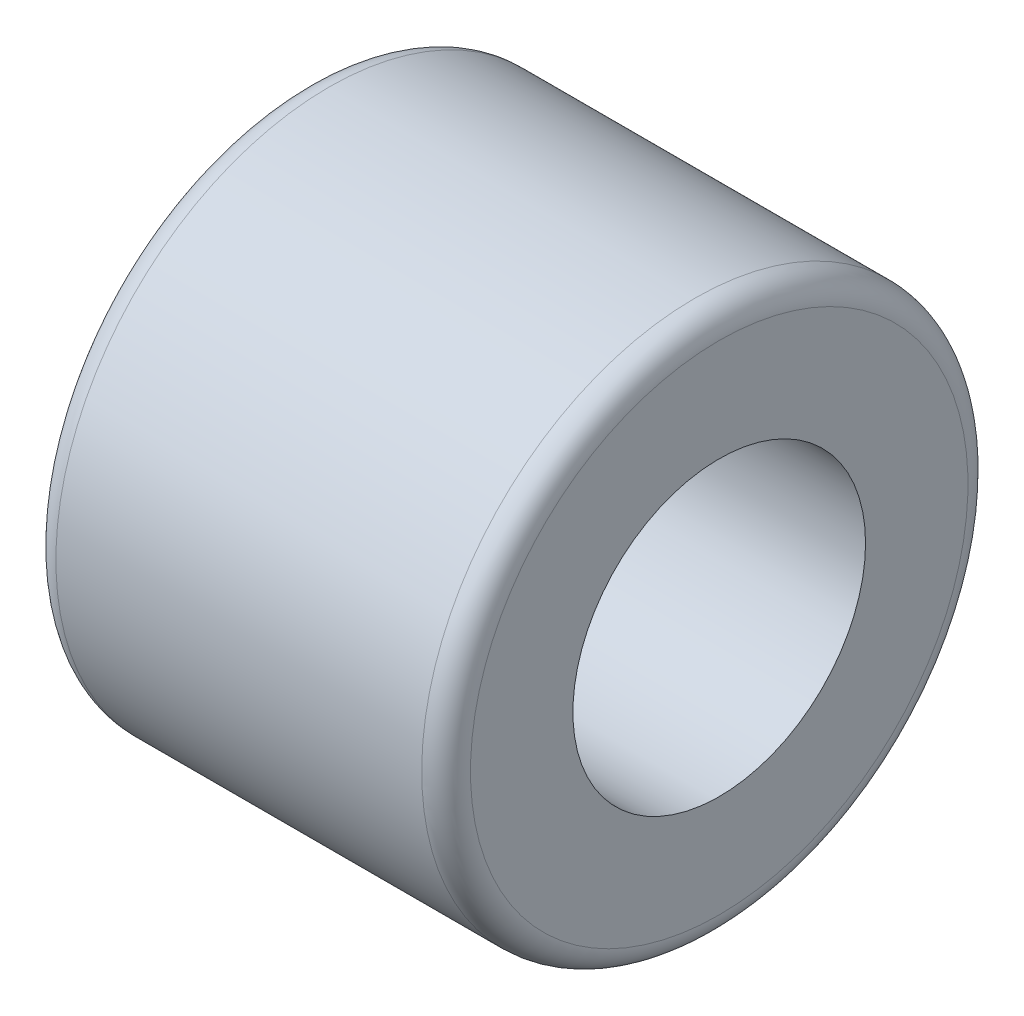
ISO-10303-21;
HEADER;
FILE_DESCRIPTION(('STEP AP214'),'2;1');
FILE_NAME('part.step','',(''),(''),'','','');
FILE_SCHEMA(('AUTOMOTIVE_DESIGN { 1 0 10303 214 1 1 1 1 }'));
ENDSEC;
DATA;
#1=APPLICATION_CONTEXT('core data for automotive mechanical design processes');
#2=APPLICATION_PROTOCOL_DEFINITION('international standard','automotive_design',2000,#1);
#3=PRODUCT_CONTEXT('',#1,'mechanical');
#4=PRODUCT('Part','Part','',(#3));
#5=PRODUCT_RELATED_PRODUCT_CATEGORY('part','',(#4));
#6=PRODUCT_DEFINITION_FORMATION('','',#4);
#7=PRODUCT_DEFINITION_CONTEXT('part definition',#1,'design');
#8=PRODUCT_DEFINITION('design','',#6,#7);
#9=PRODUCT_DEFINITION_SHAPE('','',#8);
#10=(LENGTH_UNIT() NAMED_UNIT(*) SI_UNIT(.MILLI.,.METRE.));
#11=(NAMED_UNIT(*) PLANE_ANGLE_UNIT() SI_UNIT($,.RADIAN.));
#12=(NAMED_UNIT(*) SI_UNIT($,.STERADIAN.) SOLID_ANGLE_UNIT());
#13=UNCERTAINTY_MEASURE_WITH_UNIT(LENGTH_MEASURE(1.E-05),#10,'distance_accuracy_value','');
#14=(GEOMETRIC_REPRESENTATION_CONTEXT(3) GLOBAL_UNCERTAINTY_ASSIGNED_CONTEXT((#13)) GLOBAL_UNIT_ASSIGNED_CONTEXT((#10,
#11,#12)) REPRESENTATION_CONTEXT('',''));
#15=CARTESIAN_POINT('',(0.,0.,0.));
#16=DIRECTION('',(0.,0.,1.));
#17=DIRECTION('',(1.,0.,0.));
#18=AXIS2_PLACEMENT_3D('',#15,#16,#17);
#19=CARTESIAN_POINT('',(-7.32035907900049,0.,0.));
#20=DIRECTION('',(-1.,0.,0.));
#21=DIRECTION('',(0.,-1.,0.));
#22=AXIS2_PLACEMENT_3D('',#19,#20,#21);
#23=PLANE('',#22);
#24=CARTESIAN_POINT('',(-7.32035907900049,0.,0.));
#25=DIRECTION('',(-1.,0.,0.));
#26=DIRECTION('',(0.,-1.,0.));
#27=AXIS2_PLACEMENT_3D('',#24,#25,#26);
#28=CIRCLE('',#27,5.1);
#29=CARTESIAN_POINT('',(-7.32035907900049,-5.1,0.));
#30=VERTEX_POINT('',#29);
#31=EDGE_CURVE('E39',#30,#30,#28,.T.);
#32=ORIENTED_EDGE('',*,*,#31,.T.);
#33=EDGE_LOOP('',(#32));
#34=FACE_BOUND('',#33,.T.);
#35=CARTESIAN_POINT('',(-7.32035907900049,0.,0.));
#36=DIRECTION('',(-1.,0.,0.));
#37=DIRECTION('',(0.,-1.,0.));
#38=AXIS2_PLACEMENT_3D('',#35,#36,#37);
#39=CIRCLE('',#38,3.);
#40=CARTESIAN_POINT('',(-7.32035907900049,-3.,0.));
#41=VERTEX_POINT('',#40);
#42=EDGE_CURVE('E52',#41,#41,#39,.T.);
#43=ORIENTED_EDGE('',*,*,#42,.F.);
#44=EDGE_LOOP('',(#43));
#45=FACE_BOUND('',#44,.T.);
#46=ADVANCED_FACE('F32',(#34,#45),#23,.T.);
#47=CARTESIAN_POINT('',(1.17964092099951,0.,0.));
#48=DIRECTION('',(1.,0.,0.));
#49=DIRECTION('',(0.,1.,0.));
#50=AXIS2_PLACEMENT_3D('',#47,#48,#49);
#51=CYLINDRICAL_SURFACE('',#50,5.6);
#52=CARTESIAN_POINT('',(-6.82035907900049,0.,0.));
#53=DIRECTION('',(-1.,0.,0.));
#54=DIRECTION('',(0.,-1.,0.));
#55=AXIS2_PLACEMENT_3D('',#52,#53,#54);
#56=CIRCLE('',#55,5.6);
#57=CARTESIAN_POINT('',(-6.82035907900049,-5.6,0.));
#58=VERTEX_POINT('',#57);
#59=EDGE_CURVE('E43',#58,#58,#56,.F.);
#60=ORIENTED_EDGE('',*,*,#59,.T.);
#61=EDGE_LOOP('',(#60));
#62=FACE_BOUND('',#61,.T.);
#63=CARTESIAN_POINT('',(0.679640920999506,0.,0.));
#64=DIRECTION('',(1.,0.,0.));
#65=DIRECTION('',(0.,1.,0.));
#66=AXIS2_PLACEMENT_3D('',#63,#64,#65);
#67=CIRCLE('',#66,5.6);
#68=CARTESIAN_POINT('',(0.679640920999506,5.6,0.));
#69=VERTEX_POINT('',#68);
#70=EDGE_CURVE('E47',#69,#69,#67,.F.);
#71=ORIENTED_EDGE('',*,*,#70,.T.);
#72=EDGE_LOOP('',(#71));
#73=FACE_BOUND('',#72,.T.);
#74=ADVANCED_FACE('F63',(#62,#73),#51,.T.);
#75=CARTESIAN_POINT('',(1.17964092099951,5.6,0.));
#76=DIRECTION('',(1.,0.,0.));
#77=DIRECTION('',(0.,1.,0.));
#78=AXIS2_PLACEMENT_3D('',#75,#76,#77);
#79=PLANE('',#78);
#80=CARTESIAN_POINT('',(1.17964092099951,0.,0.));
#81=DIRECTION('',(1.,0.,0.));
#82=DIRECTION('',(0.,1.,0.));
#83=AXIS2_PLACEMENT_3D('',#80,#81,#82);
#84=CIRCLE('',#83,5.1);
#85=CARTESIAN_POINT('',(1.17964092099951,5.1,0.));
#86=VERTEX_POINT('',#85);
#87=EDGE_CURVE('E10',#86,#86,#84,.T.);
#88=ORIENTED_EDGE('',*,*,#87,.T.);
#89=EDGE_LOOP('',(#88));
#90=FACE_BOUND('',#89,.T.);
#91=CARTESIAN_POINT('',(1.17964092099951,0.,0.));
#92=DIRECTION('',(1.,0.,0.));
#93=DIRECTION('',(0.,0.,-1.));
#94=AXIS2_PLACEMENT_3D('',#91,#92,#93);
#95=CIRCLE('',#94,3.);
#96=CARTESIAN_POINT('',(1.17964092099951,0.,-3.));
#97=VERTEX_POINT('',#96);
#98=EDGE_CURVE('E55',#97,#97,#95,.T.);
#99=ORIENTED_EDGE('',*,*,#98,.F.);
#100=EDGE_LOOP('',(#99));
#101=FACE_BOUND('',#100,.T.);
#102=ADVANCED_FACE('F61',(#90,#101),#79,.T.);
#103=CARTESIAN_POINT('',(-14.8203590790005,0.,0.));
#104=DIRECTION('',(1.,0.,0.));
#105=DIRECTION('',(0.,0.,-1.));
#106=AXIS2_PLACEMENT_3D('',#103,#104,#105);
#107=CYLINDRICAL_SURFACE('',#106,3.);
#108=ORIENTED_EDGE('',*,*,#42,.T.);
#109=EDGE_LOOP('',(#108));
#110=FACE_BOUND('',#109,.T.);
#111=ORIENTED_EDGE('',*,*,#98,.T.);
#112=EDGE_LOOP('',(#111));
#113=FACE_BOUND('',#112,.T.);
#114=ADVANCED_FACE('F59',(#110,#113),#107,.F.);
#115=CARTESIAN_POINT('',(-6.82035907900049,0.,0.));
#116=DIRECTION('',(-1.,0.,0.));
#117=DIRECTION('',(0.,-1.,0.));
#118=AXIS2_PLACEMENT_3D('',#115,#116,#117);
#119=TOROIDAL_SURFACE('',#118,5.1,0.5);
#120=ORIENTED_EDGE('',*,*,#31,.F.);
#121=EDGE_LOOP('',(#120));
#122=FACE_BOUND('',#121,.T.);
#123=ORIENTED_EDGE('',*,*,#59,.F.);
#124=EDGE_LOOP('',(#123));
#125=FACE_BOUND('',#124,.T.);
#126=ADVANCED_FACE('F69',(#122,#125),#119,.T.);
#127=CARTESIAN_POINT('',(0.679640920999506,0.,0.));
#128=DIRECTION('',(1.,0.,0.));
#129=DIRECTION('',(0.,1.,0.));
#130=AXIS2_PLACEMENT_3D('',#127,#128,#129);
#131=TOROIDAL_SURFACE('',#130,5.1,0.5);
#132=ORIENTED_EDGE('',*,*,#70,.F.);
#133=EDGE_LOOP('',(#132));
#134=FACE_BOUND('',#133,.T.);
#135=ORIENTED_EDGE('',*,*,#87,.F.);
#136=EDGE_LOOP('',(#135));
#137=FACE_BOUND('',#136,.T.);
#138=ADVANCED_FACE('F34',(#134,#137),#131,.T.);
#139=CLOSED_SHELL('',(#46,#74,#102,#114,#126,#138));
#140=MANIFOLD_SOLID_BREP('B2',#139);
#141=ADVANCED_BREP_SHAPE_REPRESENTATION('',(#18,#140),#14);
#142=SHAPE_DEFINITION_REPRESENTATION(#9,#141);
ENDSEC;
END-ISO-10303-21;
